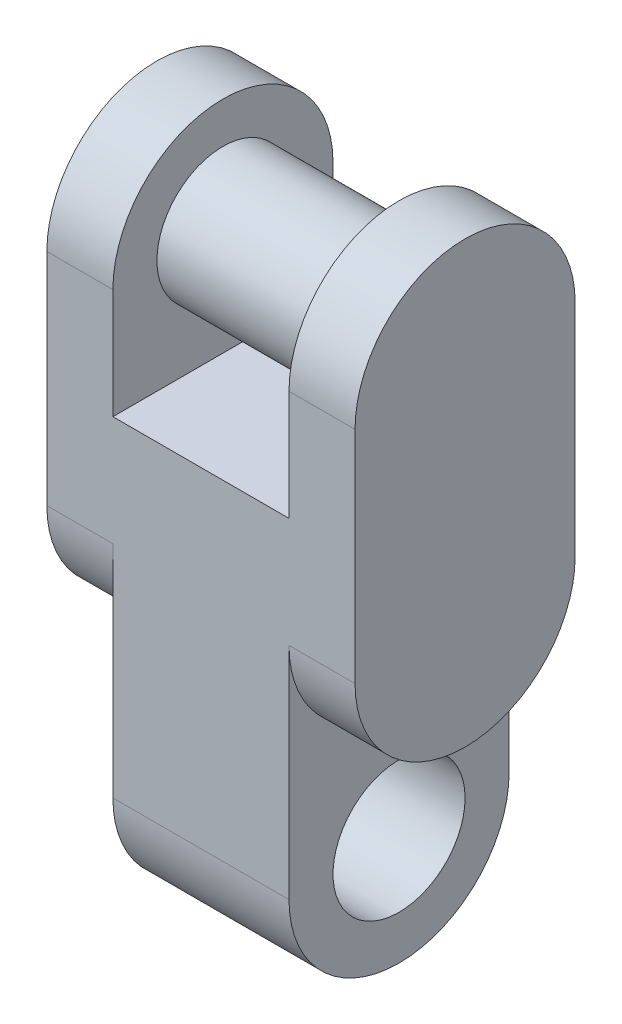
ISO-10303-21;
HEADER;
FILE_DESCRIPTION(('STEP AP214'),'2;1');
FILE_NAME('part.step','',(''),(''),'','','');
FILE_SCHEMA(('AUTOMOTIVE_DESIGN { 1 0 10303 214 1 1 1 1 }'));
ENDSEC;
DATA;
#1=APPLICATION_CONTEXT('core data for automotive mechanical design processes');
#2=APPLICATION_PROTOCOL_DEFINITION('international standard','automotive_design',2000,#1);
#3=PRODUCT_CONTEXT('',#1,'mechanical');
#4=PRODUCT('Part','Part','',(#3));
#5=PRODUCT_RELATED_PRODUCT_CATEGORY('part','',(#4));
#6=PRODUCT_DEFINITION_FORMATION('','',#4);
#7=PRODUCT_DEFINITION_CONTEXT('part definition',#1,'design');
#8=PRODUCT_DEFINITION('design','',#6,#7);
#9=PRODUCT_DEFINITION_SHAPE('','',#8);
#10=(LENGTH_UNIT() NAMED_UNIT(*) SI_UNIT(.MILLI.,.METRE.));
#11=(NAMED_UNIT(*) PLANE_ANGLE_UNIT() SI_UNIT($,.RADIAN.));
#12=(NAMED_UNIT(*) SI_UNIT($,.STERADIAN.) SOLID_ANGLE_UNIT());
#13=UNCERTAINTY_MEASURE_WITH_UNIT(LENGTH_MEASURE(1.E-05),#10,'distance_accuracy_value','');
#14=(GEOMETRIC_REPRESENTATION_CONTEXT(3) GLOBAL_UNCERTAINTY_ASSIGNED_CONTEXT((#13)) GLOBAL_UNIT_ASSIGNED_CONTEXT((#10,
#11,#12)) REPRESENTATION_CONTEXT('',''));
#15=CARTESIAN_POINT('',(0.,0.,0.));
#16=DIRECTION('',(0.,0.,1.));
#17=DIRECTION('',(1.,0.,0.));
#18=AXIS2_PLACEMENT_3D('',#15,#16,#17);
#19=CARTESIAN_POINT('',(-47.8928241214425,0.,10.));
#20=DIRECTION('',(1.,0.,0.));
#21=DIRECTION('',(0.,0.,-1.));
#22=AXIS2_PLACEMENT_3D('',#19,#20,#21);
#23=PLANE('',#22);
#24=CARTESIAN_POINT('',(-47.8928241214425,13.8584965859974,5.));
#25=DIRECTION('',(-1.,0.,0.));
#26=DIRECTION('',(0.,0.,1.));
#27=AXIS2_PLACEMENT_3D('',#24,#25,#26);
#28=CIRCLE('',#27,5.);
#29=CARTESIAN_POINT('',(-47.8928241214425,13.8584965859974,0.));
#30=VERTEX_POINT('',#29);
#31=CARTESIAN_POINT('',(-47.8928241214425,13.8584965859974,10.));
#32=VERTEX_POINT('',#31);
#33=EDGE_CURVE('E351',#30,#32,#28,.T.);
#34=ORIENTED_EDGE('',*,*,#33,.T.);
#35=DIRECTION('',(0.,-1.,0.));
#36=VECTOR('',#35,1.);
#37=CARTESIAN_POINT('',(-47.8928241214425,0.,10.));
#38=LINE('',#37,#36);
#39=CARTESIAN_POINT('',(-47.8928241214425,23.8584965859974,10.));
#40=VERTEX_POINT('',#39);
#41=EDGE_CURVE('E244',#40,#32,#38,.T.);
#42=ORIENTED_EDGE('',*,*,#41,.F.);
#43=CARTESIAN_POINT('',(-47.8928241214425,23.8584965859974,5.));
#44=DIRECTION('',(1.,0.,0.));
#45=DIRECTION('',(0.,0.,-1.));
#46=AXIS2_PLACEMENT_3D('',#43,#44,#45);
#47=CIRCLE('',#46,5.);
#48=CARTESIAN_POINT('',(-47.8928241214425,23.8584965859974,0.));
#49=VERTEX_POINT('',#48);
#50=EDGE_CURVE('E177',#49,#40,#47,.T.);
#51=ORIENTED_EDGE('',*,*,#50,.F.);
#52=DIRECTION('',(0.,-1.,0.));
#53=VECTOR('',#52,1.);
#54=CARTESIAN_POINT('',(-47.8928241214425,0.,0.));
#55=LINE('',#54,#53);
#56=EDGE_CURVE('E140',#49,#30,#55,.T.);
#57=ORIENTED_EDGE('',*,*,#56,.T.);
#58=EDGE_LOOP('',(#34,#42,#51,#57));
#59=FACE_BOUND('',#58,.T.);
#60=ADVANCED_FACE('F93',(#59),#23,.F.);
#61=CARTESIAN_POINT('',(-33.8928241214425,0.,10.));
#62=DIRECTION('',(-1.,0.,0.));
#63=DIRECTION('',(0.,0.,1.));
#64=AXIS2_PLACEMENT_3D('',#61,#62,#63);
#65=PLANE('',#64);
#66=CARTESIAN_POINT('',(-33.8928241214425,13.8584965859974,5.));
#67=DIRECTION('',(1.,0.,0.));
#68=DIRECTION('',(0.,0.,-1.));
#69=AXIS2_PLACEMENT_3D('',#66,#67,#68);
#70=CIRCLE('',#69,5.);
#71=CARTESIAN_POINT('',(-33.8928241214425,13.8584965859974,10.));
#72=VERTEX_POINT('',#71);
#73=CARTESIAN_POINT('',(-33.8928241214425,13.8584965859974,0.));
#74=VERTEX_POINT('',#73);
#75=EDGE_CURVE('E255',#72,#74,#70,.T.);
#76=ORIENTED_EDGE('',*,*,#75,.T.);
#77=DIRECTION('',(0.,1.,0.));
#78=VECTOR('',#77,1.);
#79=CARTESIAN_POINT('',(-33.8928241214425,0.,0.));
#80=LINE('',#79,#78);
#81=CARTESIAN_POINT('',(-33.8928241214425,23.8584965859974,0.));
#82=VERTEX_POINT('',#81);
#83=EDGE_CURVE('E155',#74,#82,#80,.T.);
#84=ORIENTED_EDGE('',*,*,#83,.T.);
#85=CARTESIAN_POINT('',(-33.8928241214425,23.8584965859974,5.));
#86=DIRECTION('',(1.,0.,0.));
#87=DIRECTION('',(0.,0.,-1.));
#88=AXIS2_PLACEMENT_3D('',#85,#86,#87);
#89=CIRCLE('',#88,5.);
#90=CARTESIAN_POINT('',(-33.8928241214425,23.8584965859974,10.));
#91=VERTEX_POINT('',#90);
#92=EDGE_CURVE('E205',#82,#91,#89,.T.);
#93=ORIENTED_EDGE('',*,*,#92,.T.);
#94=DIRECTION('',(0.,1.,0.));
#95=VECTOR('',#94,1.);
#96=CARTESIAN_POINT('',(-33.8928241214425,0.,10.));
#97=LINE('',#96,#95);
#98=EDGE_CURVE('E258',#72,#91,#97,.T.);
#99=ORIENTED_EDGE('',*,*,#98,.F.);
#100=EDGE_LOOP('',(#76,#84,#93,#99));
#101=FACE_BOUND('',#100,.T.);
#102=ADVANCED_FACE('F252',(#101),#65,.F.);
#103=CARTESIAN_POINT('',(0.,0.,0.));
#104=DIRECTION('',(0.,0.,1.));
#105=DIRECTION('',(1.,0.,0.));
#106=AXIS2_PLACEMENT_3D('',#103,#104,#105);
#107=PLANE('',#106);
#108=DIRECTION('',(0.,-1.,0.));
#109=VECTOR('',#108,1.);
#110=CARTESIAN_POINT('',(-44.8928241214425,0.,0.));
#111=LINE('',#110,#109);
#112=CARTESIAN_POINT('',(-44.8928241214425,13.8584965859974,0.));
#113=VERTEX_POINT('',#112);
#114=CARTESIAN_POINT('',(-44.8928241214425,3.85849658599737,0.));
#115=VERTEX_POINT('',#114);
#116=EDGE_CURVE('E161',#113,#115,#111,.T.);
#117=ORIENTED_EDGE('',*,*,#116,.F.);
#118=DIRECTION('',(-1.,0.,0.));
#119=VECTOR('',#118,1.);
#120=CARTESIAN_POINT('',(-44.8928241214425,13.8584965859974,0.));
#121=LINE('',#120,#119);
#122=EDGE_CURVE('E271',#113,#30,#121,.T.);
#123=ORIENTED_EDGE('',*,*,#122,.T.);
#124=ORIENTED_EDGE('',*,*,#56,.F.);
#125=DIRECTION('',(1.,0.,0.));
#126=VECTOR('',#125,1.);
#127=CARTESIAN_POINT('',(-59.8928241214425,23.8584965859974,0.));
#128=LINE('',#127,#126);
#129=CARTESIAN_POINT('',(-44.8928241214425,23.8584965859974,0.));
#130=VERTEX_POINT('',#129);
#131=EDGE_CURVE('E12',#49,#130,#128,.T.);
#132=ORIENTED_EDGE('',*,*,#131,.T.);
#133=DIRECTION('',(0.,-1.,0.));
#134=VECTOR('',#133,1.);
#135=CARTESIAN_POINT('',(-44.8928241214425,0.,0.));
#136=LINE('',#135,#134);
#137=CARTESIAN_POINT('',(-44.8928241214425,18.8584965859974,0.));
#138=VERTEX_POINT('',#137);
#139=EDGE_CURVE('E131',#130,#138,#136,.T.);
#140=ORIENTED_EDGE('',*,*,#139,.T.);
#141=DIRECTION('',(1.,0.,0.));
#142=VECTOR('',#141,1.);
#143=CARTESIAN_POINT('',(0.,18.8584965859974,0.));
#144=LINE('',#143,#142);
#145=CARTESIAN_POINT('',(-36.8928241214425,18.8584965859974,0.));
#146=VERTEX_POINT('',#145);
#147=EDGE_CURVE('E136',#138,#146,#144,.T.);
#148=ORIENTED_EDGE('',*,*,#147,.T.);
#149=DIRECTION('',(0.,-1.,0.));
#150=VECTOR('',#149,1.);
#151=CARTESIAN_POINT('',(-36.8928241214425,0.,0.));
#152=LINE('',#151,#150);
#153=CARTESIAN_POINT('',(-36.8928241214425,23.8584965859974,0.));
#154=VERTEX_POINT('',#153);
#155=EDGE_CURVE('E153',#154,#146,#152,.T.);
#156=ORIENTED_EDGE('',*,*,#155,.F.);
#157=EDGE_CURVE('E97',#154,#82,#128,.T.);
#158=ORIENTED_EDGE('',*,*,#157,.T.);
#159=ORIENTED_EDGE('',*,*,#83,.F.);
#160=DIRECTION('',(1.,0.,0.));
#161=VECTOR('',#160,1.);
#162=CARTESIAN_POINT('',(-36.8928241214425,13.8584965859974,0.));
#163=LINE('',#162,#161);
#164=CARTESIAN_POINT('',(-36.8928241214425,13.8584965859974,0.));
#165=VERTEX_POINT('',#164);
#166=EDGE_CURVE('E266',#165,#74,#163,.T.);
#167=ORIENTED_EDGE('',*,*,#166,.F.);
#168=DIRECTION('',(0.,-1.,0.));
#169=VECTOR('',#168,1.);
#170=CARTESIAN_POINT('',(-36.8928241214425,0.,0.));
#171=LINE('',#170,#169);
#172=CARTESIAN_POINT('',(-36.8928241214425,3.85849658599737,0.));
#173=VERTEX_POINT('',#172);
#174=EDGE_CURVE('E170',#165,#173,#171,.T.);
#175=ORIENTED_EDGE('',*,*,#174,.T.);
#176=DIRECTION('',(1.,0.,0.));
#177=VECTOR('',#176,1.);
#178=CARTESIAN_POINT('',(-46.8928241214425,3.85849658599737,0.));
#179=LINE('',#178,#177);
#180=EDGE_CURVE('E173',#115,#173,#179,.T.);
#181=ORIENTED_EDGE('',*,*,#180,.F.);
#182=EDGE_LOOP('',(#117,#123,#124,#132,#140,#148,#156,#158,#159,#167,#175,#181));
#183=FACE_BOUND('',#182,.T.);
#184=ADVANCED_FACE('F133',(#183),#107,.F.);
#185=CARTESIAN_POINT('',(0.,0.,10.));
#186=DIRECTION('',(0.,0.,1.));
#187=DIRECTION('',(1.,0.,0.));
#188=AXIS2_PLACEMENT_3D('',#185,#186,#187);
#189=PLANE('',#188);
#190=DIRECTION('',(-1.,0.,0.));
#191=VECTOR('',#190,1.);
#192=CARTESIAN_POINT('',(-44.8928241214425,13.8584965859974,10.));
#193=LINE('',#192,#191);
#194=CARTESIAN_POINT('',(-44.8928241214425,13.8584965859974,10.));
#195=VERTEX_POINT('',#194);
#196=EDGE_CURVE('E243',#195,#32,#193,.T.);
#197=ORIENTED_EDGE('',*,*,#196,.F.);
#198=DIRECTION('',(0.,-1.,0.));
#199=VECTOR('',#198,1.);
#200=CARTESIAN_POINT('',(-44.8928241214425,0.,10.));
#201=LINE('',#200,#199);
#202=CARTESIAN_POINT('',(-44.8928241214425,3.85849658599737,10.));
#203=VERTEX_POINT('',#202);
#204=EDGE_CURVE('E148',#195,#203,#201,.T.);
#205=ORIENTED_EDGE('',*,*,#204,.T.);
#206=DIRECTION('',(1.,0.,0.));
#207=VECTOR('',#206,1.);
#208=CARTESIAN_POINT('',(-46.8928241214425,3.85849658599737,10.));
#209=LINE('',#208,#207);
#210=CARTESIAN_POINT('',(-36.8928241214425,3.85849658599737,10.));
#211=VERTEX_POINT('',#210);
#212=EDGE_CURVE('E166',#203,#211,#209,.T.);
#213=ORIENTED_EDGE('',*,*,#212,.T.);
#214=DIRECTION('',(0.,-1.,0.));
#215=VECTOR('',#214,1.);
#216=CARTESIAN_POINT('',(-36.8928241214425,0.,10.));
#217=LINE('',#216,#215);
#218=CARTESIAN_POINT('',(-36.8928241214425,13.8584965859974,10.));
#219=VERTEX_POINT('',#218);
#220=EDGE_CURVE('E163',#219,#211,#217,.T.);
#221=ORIENTED_EDGE('',*,*,#220,.F.);
#222=DIRECTION('',(1.,0.,0.));
#223=VECTOR('',#222,1.);
#224=CARTESIAN_POINT('',(-36.8928241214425,13.8584965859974,10.));
#225=LINE('',#224,#223);
#226=EDGE_CURVE('E278',#219,#72,#225,.T.);
#227=ORIENTED_EDGE('',*,*,#226,.T.);
#228=ORIENTED_EDGE('',*,*,#98,.T.);
#229=DIRECTION('',(1.,0.,0.));
#230=VECTOR('',#229,1.);
#231=CARTESIAN_POINT('',(-59.8928241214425,23.8584965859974,10.));
#232=LINE('',#231,#230);
#233=CARTESIAN_POINT('',(-36.8928241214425,23.8584965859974,10.));
#234=VERTEX_POINT('',#233);
#235=EDGE_CURVE('E282',#234,#91,#232,.T.);
#236=ORIENTED_EDGE('',*,*,#235,.F.);
#237=DIRECTION('',(0.,-1.,0.));
#238=VECTOR('',#237,1.);
#239=CARTESIAN_POINT('',(-36.8928241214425,0.,10.));
#240=LINE('',#239,#238);
#241=CARTESIAN_POINT('',(-36.8928241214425,18.8584965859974,10.));
#242=VERTEX_POINT('',#241);
#243=EDGE_CURVE('E296',#234,#242,#240,.T.);
#244=ORIENTED_EDGE('',*,*,#243,.T.);
#245=DIRECTION('',(1.,0.,0.));
#246=VECTOR('',#245,1.);
#247=CARTESIAN_POINT('',(0.,18.8584965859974,10.));
#248=LINE('',#247,#246);
#249=CARTESIAN_POINT('',(-44.8928241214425,18.8584965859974,10.));
#250=VERTEX_POINT('',#249);
#251=EDGE_CURVE('E298',#250,#242,#248,.T.);
#252=ORIENTED_EDGE('',*,*,#251,.F.);
#253=DIRECTION('',(0.,-1.,0.));
#254=VECTOR('',#253,1.);
#255=CARTESIAN_POINT('',(-44.8928241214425,0.,10.));
#256=LINE('',#255,#254);
#257=CARTESIAN_POINT('',(-44.8928241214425,23.8584965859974,10.));
#258=VERTEX_POINT('',#257);
#259=EDGE_CURVE('E117',#258,#250,#256,.T.);
#260=ORIENTED_EDGE('',*,*,#259,.F.);
#261=EDGE_CURVE('E284',#40,#258,#232,.T.);
#262=ORIENTED_EDGE('',*,*,#261,.F.);
#263=ORIENTED_EDGE('',*,*,#41,.T.);
#264=EDGE_LOOP('',(#197,#205,#213,#221,#227,#228,#236,#244,#252,#260,#262,#263));
#265=FACE_BOUND('',#264,.T.);
#266=ADVANCED_FACE('F240',(#265),#189,.T.);
#267=CARTESIAN_POINT('',(-36.8928241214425,0.,10.));
#268=DIRECTION('',(1.,0.,0.));
#269=DIRECTION('',(0.,0.,-1.));
#270=AXIS2_PLACEMENT_3D('',#267,#268,#269);
#271=PLANE('',#270);
#272=CARTESIAN_POINT('',(-36.8928241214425,23.9948100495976,5.));
#273=DIRECTION('',(1.,0.,0.));
#274=DIRECTION('',(0.,0.,-1.));
#275=AXIS2_PLACEMENT_3D('',#272,#273,#274);
#276=CIRCLE('',#275,3.);
#277=CARTESIAN_POINT('',(-36.8928241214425,23.9948100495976,2.));
#278=VERTEX_POINT('',#277);
#279=EDGE_CURVE('E175',#278,#278,#276,.F.);
#280=ORIENTED_EDGE('',*,*,#279,.F.);
#281=EDGE_LOOP('',(#280));
#282=FACE_BOUND('',#281,.T.);
#283=CARTESIAN_POINT('',(-36.8928241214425,23.8584965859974,5.));
#284=DIRECTION('',(1.,0.,0.));
#285=DIRECTION('',(0.,0.,-1.));
#286=AXIS2_PLACEMENT_3D('',#283,#284,#285);
#287=CIRCLE('',#286,5.);
#288=EDGE_CURVE('E202',#154,#234,#287,.T.);
#289=ORIENTED_EDGE('',*,*,#288,.F.);
#290=ORIENTED_EDGE('',*,*,#155,.T.);
#291=DIRECTION('',(0.,0.,-1.));
#292=VECTOR('',#291,1.);
#293=CARTESIAN_POINT('',(-36.8928241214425,18.8584965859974,10.));
#294=LINE('',#293,#292);
#295=EDGE_CURVE('E147',#242,#146,#294,.T.);
#296=ORIENTED_EDGE('',*,*,#295,.F.);
#297=ORIENTED_EDGE('',*,*,#243,.F.);
#298=EDGE_LOOP('',(#289,#290,#296,#297));
#299=FACE_BOUND('',#298,.T.);
#300=ADVANCED_FACE('F299',(#282,#299),#271,.F.);
#301=CARTESIAN_POINT('',(-44.8928241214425,0.,10.));
#302=DIRECTION('',(1.,0.,0.));
#303=DIRECTION('',(0.,0.,-1.));
#304=AXIS2_PLACEMENT_3D('',#301,#302,#303);
#305=PLANE('',#304);
#306=CARTESIAN_POINT('',(-44.8928241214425,23.9948100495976,5.));
#307=DIRECTION('',(1.,0.,0.));
#308=DIRECTION('',(0.,0.,-1.));
#309=AXIS2_PLACEMENT_3D('',#306,#307,#308);
#310=CIRCLE('',#309,3.);
#311=CARTESIAN_POINT('',(-44.8928241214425,23.9948100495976,2.));
#312=VERTEX_POINT('',#311);
#313=EDGE_CURVE('E288',#312,#312,#310,.T.);
#314=ORIENTED_EDGE('',*,*,#313,.F.);
#315=EDGE_LOOP('',(#314));
#316=FACE_BOUND('',#315,.T.);
#317=ORIENTED_EDGE('',*,*,#139,.F.);
#318=CARTESIAN_POINT('',(-44.8928241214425,23.8584965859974,5.));
#319=DIRECTION('',(1.,0.,0.));
#320=DIRECTION('',(0.,0.,-1.));
#321=AXIS2_PLACEMENT_3D('',#318,#319,#320);
#322=CIRCLE('',#321,5.);
#323=EDGE_CURVE('E285',#130,#258,#322,.T.);
#324=ORIENTED_EDGE('',*,*,#323,.T.);
#325=ORIENTED_EDGE('',*,*,#259,.T.);
#326=DIRECTION('',(0.,0.,-1.));
#327=VECTOR('',#326,1.);
#328=CARTESIAN_POINT('',(-44.8928241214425,18.8584965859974,10.));
#329=LINE('',#328,#327);
#330=EDGE_CURVE('E142',#250,#138,#329,.T.);
#331=ORIENTED_EDGE('',*,*,#330,.T.);
#332=EDGE_LOOP('',(#317,#324,#325,#331));
#333=FACE_BOUND('',#332,.T.);
#334=ADVANCED_FACE('F143',(#316,#333),#305,.T.);
#335=CARTESIAN_POINT('',(-36.8928241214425,0.,10.));
#336=DIRECTION('',(1.,0.,0.));
#337=DIRECTION('',(0.,0.,-1.));
#338=AXIS2_PLACEMENT_3D('',#335,#336,#337);
#339=PLANE('',#338);
#340=CARTESIAN_POINT('',(-36.8928241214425,3.85849658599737,5.));
#341=DIRECTION('',(1.,0.,0.));
#342=DIRECTION('',(0.,0.,-1.));
#343=AXIS2_PLACEMENT_3D('',#340,#341,#342);
#344=CIRCLE('',#343,3.);
#345=CARTESIAN_POINT('',(-36.8928241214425,3.85849658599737,2.));
#346=VERTEX_POINT('',#345);
#347=EDGE_CURVE('E171',#346,#346,#344,.T.);
#348=ORIENTED_EDGE('',*,*,#347,.F.);
#349=EDGE_LOOP('',(#348));
#350=FACE_BOUND('',#349,.T.);
#351=CARTESIAN_POINT('',(-36.8928241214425,3.85849658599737,5.));
#352=DIRECTION('',(1.,0.,0.));
#353=DIRECTION('',(0.,0.,-1.));
#354=AXIS2_PLACEMENT_3D('',#351,#352,#353);
#355=CIRCLE('',#354,5.);
#356=EDGE_CURVE('E108',#211,#173,#355,.T.);
#357=ORIENTED_EDGE('',*,*,#356,.T.);
#358=ORIENTED_EDGE('',*,*,#174,.F.);
#359=CARTESIAN_POINT('',(-36.8928241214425,13.8584965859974,5.));
#360=DIRECTION('',(1.,0.,0.));
#361=DIRECTION('',(0.,0.,-1.));
#362=AXIS2_PLACEMENT_3D('',#359,#360,#361);
#363=CIRCLE('',#362,5.);
#364=EDGE_CURVE('E265',#219,#165,#363,.T.);
#365=ORIENTED_EDGE('',*,*,#364,.F.);
#366=ORIENTED_EDGE('',*,*,#220,.T.);
#367=EDGE_LOOP('',(#357,#358,#365,#366));
#368=FACE_BOUND('',#367,.T.);
#369=ADVANCED_FACE('F95',(#350,#368),#339,.T.);
#370=CARTESIAN_POINT('',(-44.8928241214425,0.,10.));
#371=DIRECTION('',(1.,0.,0.));
#372=DIRECTION('',(0.,0.,-1.));
#373=AXIS2_PLACEMENT_3D('',#370,#371,#372);
#374=PLANE('',#373);
#375=CARTESIAN_POINT('',(-44.8928241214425,3.85849658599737,5.));
#376=DIRECTION('',(1.,0.,0.));
#377=DIRECTION('',(0.,0.,-1.));
#378=AXIS2_PLACEMENT_3D('',#375,#376,#377);
#379=CIRCLE('',#378,3.);
#380=CARTESIAN_POINT('',(-44.8928241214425,3.85849658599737,2.));
#381=VERTEX_POINT('',#380);
#382=EDGE_CURVE('E167',#381,#381,#379,.T.);
#383=ORIENTED_EDGE('',*,*,#382,.T.);
#384=EDGE_LOOP('',(#383));
#385=FACE_BOUND('',#384,.T.);
#386=ORIENTED_EDGE('',*,*,#116,.T.);
#387=CARTESIAN_POINT('',(-44.8928241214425,3.85849658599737,5.));
#388=DIRECTION('',(1.,0.,0.));
#389=DIRECTION('',(0.,0.,-1.));
#390=AXIS2_PLACEMENT_3D('',#387,#388,#389);
#391=CIRCLE('',#390,5.);
#392=EDGE_CURVE('E226',#203,#115,#391,.T.);
#393=ORIENTED_EDGE('',*,*,#392,.F.);
#394=ORIENTED_EDGE('',*,*,#204,.F.);
#395=CARTESIAN_POINT('',(-44.8928241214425,13.8584965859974,5.));
#396=DIRECTION('',(-1.,0.,0.));
#397=DIRECTION('',(0.,0.,1.));
#398=AXIS2_PLACEMENT_3D('',#395,#396,#397);
#399=CIRCLE('',#398,5.);
#400=EDGE_CURVE('E274',#113,#195,#399,.T.);
#401=ORIENTED_EDGE('',*,*,#400,.F.);
#402=EDGE_LOOP('',(#386,#393,#394,#401));
#403=FACE_BOUND('',#402,.T.);
#404=ADVANCED_FACE('F234',(#385,#403),#374,.F.);
#405=CARTESIAN_POINT('',(0.,18.8584965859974,10.));
#406=DIRECTION('',(0.,1.,0.));
#407=DIRECTION('',(0.,0.,1.));
#408=AXIS2_PLACEMENT_3D('',#405,#406,#407);
#409=PLANE('',#408);
#410=ORIENTED_EDGE('',*,*,#147,.F.);
#411=ORIENTED_EDGE('',*,*,#330,.F.);
#412=ORIENTED_EDGE('',*,*,#251,.T.);
#413=ORIENTED_EDGE('',*,*,#295,.T.);
#414=EDGE_LOOP('',(#410,#411,#412,#413));
#415=FACE_BOUND('',#414,.T.);
#416=ADVANCED_FACE('F151',(#415),#409,.T.);
#417=CARTESIAN_POINT('',(-46.8928241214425,3.85849658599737,5.));
#418=DIRECTION('',(1.,0.,0.));
#419=DIRECTION('',(0.,0.,-1.));
#420=AXIS2_PLACEMENT_3D('',#417,#418,#419);
#421=CYLINDRICAL_SURFACE('',#420,3.);
#422=ORIENTED_EDGE('',*,*,#347,.T.);
#423=EDGE_LOOP('',(#422));
#424=FACE_BOUND('',#423,.T.);
#425=ORIENTED_EDGE('',*,*,#382,.F.);
#426=EDGE_LOOP('',(#425));
#427=FACE_BOUND('',#426,.T.);
#428=ADVANCED_FACE('F325',(#424,#427),#421,.F.);
#429=CARTESIAN_POINT('',(-46.8928241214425,3.85849658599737,5.));
#430=DIRECTION('',(1.,0.,0.));
#431=DIRECTION('',(0.,0.,-1.));
#432=AXIS2_PLACEMENT_3D('',#429,#430,#431);
#433=CYLINDRICAL_SURFACE('',#432,5.);
#434=ORIENTED_EDGE('',*,*,#392,.T.);
#435=ORIENTED_EDGE('',*,*,#180,.T.);
#436=ORIENTED_EDGE('',*,*,#356,.F.);
#437=ORIENTED_EDGE('',*,*,#212,.F.);
#438=EDGE_LOOP('',(#434,#435,#436,#437));
#439=FACE_BOUND('',#438,.T.);
#440=ADVANCED_FACE('F225',(#439),#433,.T.);
#441=CARTESIAN_POINT('',(-36.8928241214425,23.9948100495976,5.));
#442=DIRECTION('',(-1.,0.,0.));
#443=DIRECTION('',(0.,0.,1.));
#444=AXIS2_PLACEMENT_3D('',#441,#442,#443);
#445=CYLINDRICAL_SURFACE('',#444,3.);
#446=ORIENTED_EDGE('',*,*,#279,.T.);
#447=EDGE_LOOP('',(#446));
#448=FACE_BOUND('',#447,.T.);
#449=ORIENTED_EDGE('',*,*,#313,.T.);
#450=EDGE_LOOP('',(#449));
#451=FACE_BOUND('',#450,.T.);
#452=ADVANCED_FACE('F364',(#448,#451),#445,.T.);
#453=CARTESIAN_POINT('',(-59.8928241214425,23.8584965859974,5.));
#454=DIRECTION('',(1.,0.,0.));
#455=DIRECTION('',(0.,0.,-1.));
#456=AXIS2_PLACEMENT_3D('',#453,#454,#455);
#457=CYLINDRICAL_SURFACE('',#456,5.);
#458=ORIENTED_EDGE('',*,*,#323,.F.);
#459=ORIENTED_EDGE('',*,*,#131,.F.);
#460=ORIENTED_EDGE('',*,*,#50,.T.);
#461=ORIENTED_EDGE('',*,*,#261,.T.);
#462=EDGE_LOOP('',(#458,#459,#460,#461));
#463=FACE_BOUND('',#462,.T.);
#464=ADVANCED_FACE('F362',(#463),#457,.T.);
#465=ORIENTED_EDGE('',*,*,#288,.T.);
#466=ORIENTED_EDGE('',*,*,#235,.T.);
#467=ORIENTED_EDGE('',*,*,#92,.F.);
#468=ORIENTED_EDGE('',*,*,#157,.F.);
#469=EDGE_LOOP('',(#465,#466,#467,#468));
#470=FACE_BOUND('',#469,.T.);
#471=ADVANCED_FACE('F198',(#470),#457,.T.);
#472=CARTESIAN_POINT('',(-36.8928241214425,13.8584965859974,5.));
#473=DIRECTION('',(1.,0.,0.));
#474=DIRECTION('',(0.,0.,-1.));
#475=AXIS2_PLACEMENT_3D('',#472,#473,#474);
#476=CYLINDRICAL_SURFACE('',#475,5.);
#477=ORIENTED_EDGE('',*,*,#75,.F.);
#478=ORIENTED_EDGE('',*,*,#226,.F.);
#479=ORIENTED_EDGE('',*,*,#364,.T.);
#480=ORIENTED_EDGE('',*,*,#166,.T.);
#481=EDGE_LOOP('',(#477,#478,#479,#480));
#482=FACE_BOUND('',#481,.T.);
#483=ADVANCED_FACE('F269',(#482),#476,.T.);
#484=CARTESIAN_POINT('',(-44.8928241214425,13.8584965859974,5.));
#485=DIRECTION('',(-1.,0.,0.));
#486=DIRECTION('',(0.,0.,1.));
#487=AXIS2_PLACEMENT_3D('',#484,#485,#486);
#488=CYLINDRICAL_SURFACE('',#487,5.);
#489=ORIENTED_EDGE('',*,*,#33,.F.);
#490=ORIENTED_EDGE('',*,*,#122,.F.);
#491=ORIENTED_EDGE('',*,*,#400,.T.);
#492=ORIENTED_EDGE('',*,*,#196,.T.);
#493=EDGE_LOOP('',(#489,#490,#491,#492));
#494=FACE_BOUND('',#493,.T.);
#495=ADVANCED_FACE('F350',(#494),#488,.T.);
#496=CLOSED_SHELL('',(#60,#102,#184,#266,#300,#334,#369,#404,#416,#428,#440,#452,#464,#471,#483,#495));
#497=MANIFOLD_SOLID_BREP('B2',#496);
#498=ADVANCED_BREP_SHAPE_REPRESENTATION('',(#18,#497),#14);
#499=SHAPE_DEFINITION_REPRESENTATION(#9,#498);
ENDSEC;
END-ISO-10303-21;
